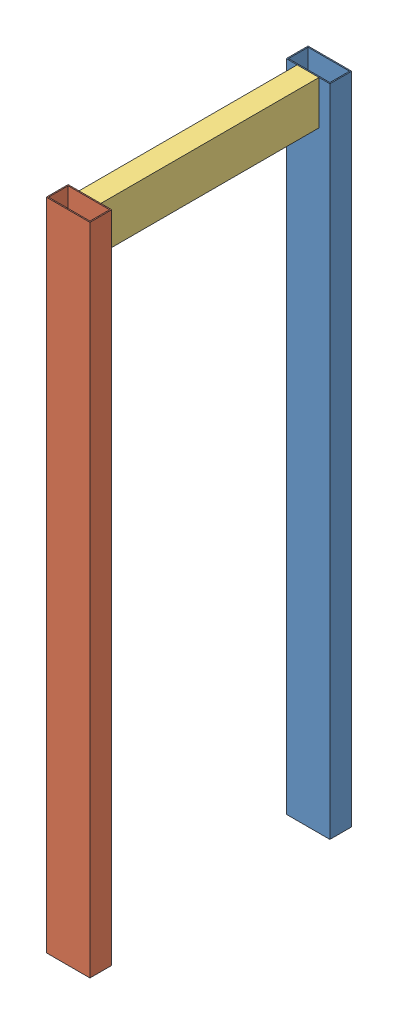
SolidWorks assembly LEG assembly for Analysis.SLDASM, configuration Défaut (file format 15000). Lengths in mm.
Overall size (80 1200 480).
3 component instances, 3 part files, 6 mates.
Components (placement in the parent):
- RLEG-1: RLEG.SLDPRT [Défaut] at (-12.3566 -772.9921 1200) size (80 1200 40)
- LLEG-1: LLEG.SLDPRT [Défaut] at (-12.3566 -772.9921 1640) x (-1 0 0) z (0 0 -1) size (80 1200 40)
- RIB1-1: RIB1.SLDPRT [Défaut] at (-12.3566 387.0079 1220) x (0 1 0) z (0 0 1) size (80 40 400)
Mates (geometry in assembly coordinates):
- Coïncidente1: coincident: plane of LLEG-1 through (27.6434 427.0079 1620) normal (0 0 -1); plane of RIB1-1 through (-12.3566 387.0079 1620) normal (0 0 1)
- Coïncidente2: coincident anti-aligned: plane of RLEG-1 through (-52.3566 427.0079 1220) normal (0 0 1); plane of RIB1-1 through (-12.3566 387.0079 1220) normal (0 0 -1)
- Coïncidente3: coincident aligned: plane of RLEG-1 through (-12.3566 427.0079 1200) normal (0 1 0); plane of RIB1-1 through (-32.3566 427.0079 1620) normal (0 1 0)
- Coïncidente4: coincident: plane of LLEG-1 through (-12.3566 427.0079 1640) normal (0 1 0); plane of RIB1-1 through (-32.3566 427.0079 1620) normal (0 1 0)
- Distance1: distance = 20 mm aligned: plane of RIB1-1 through (-32.3566 347.0079 1620) normal (-1 0 0); plane of RLEG-1 through (-52.3566 427.0079 1180) normal (-1 0 0)
- Distance2: distance = 20 mm aligned: plane of RIB1-1 through (-32.3566 347.0079 1620) normal (-1 0 0); plane of LLEG-1 through (-52.3566 427.0079 1660) normal (-1 0 0)
